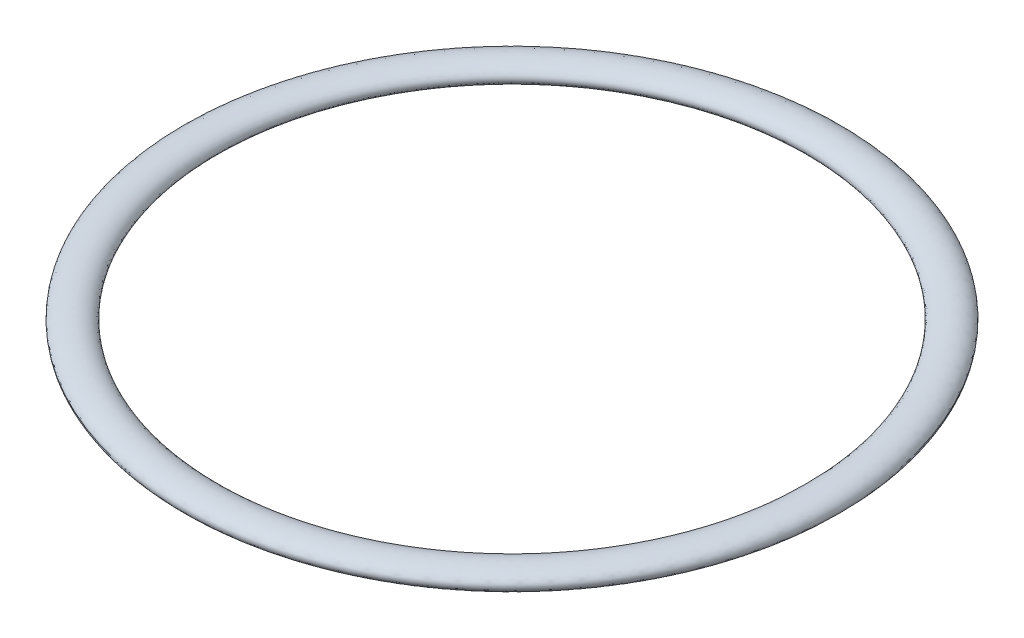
ISO-10303-21;
HEADER;
FILE_DESCRIPTION(('STEP AP214'),'2;1');
FILE_NAME('part.step','',(''),(''),'','','');
FILE_SCHEMA(('AUTOMOTIVE_DESIGN { 1 0 10303 214 1 1 1 1 }'));
ENDSEC;
DATA;
#1=APPLICATION_CONTEXT('core data for automotive mechanical design processes');
#2=APPLICATION_PROTOCOL_DEFINITION('international standard','automotive_design',2000,#1);
#3=PRODUCT_CONTEXT('',#1,'mechanical');
#4=PRODUCT('Part','Part','',(#3));
#5=PRODUCT_RELATED_PRODUCT_CATEGORY('part','',(#4));
#6=PRODUCT_DEFINITION_FORMATION('','',#4);
#7=PRODUCT_DEFINITION_CONTEXT('part definition',#1,'design');
#8=PRODUCT_DEFINITION('design','',#6,#7);
#9=PRODUCT_DEFINITION_SHAPE('','',#8);
#10=(LENGTH_UNIT() NAMED_UNIT(*) SI_UNIT(.MILLI.,.METRE.));
#11=(NAMED_UNIT(*) PLANE_ANGLE_UNIT() SI_UNIT($,.RADIAN.));
#12=(NAMED_UNIT(*) SI_UNIT($,.STERADIAN.) SOLID_ANGLE_UNIT());
#13=UNCERTAINTY_MEASURE_WITH_UNIT(LENGTH_MEASURE(1.E-05),#10,'distance_accuracy_value','');
#14=(GEOMETRIC_REPRESENTATION_CONTEXT(3) GLOBAL_UNCERTAINTY_ASSIGNED_CONTEXT((#13)) GLOBAL_UNIT_ASSIGNED_CONTEXT((#10,
#11,#12)) REPRESENTATION_CONTEXT('',''));
#15=CARTESIAN_POINT('',(0.,0.,0.));
#16=DIRECTION('',(0.,0.,1.));
#17=DIRECTION('',(1.,0.,0.));
#18=AXIS2_PLACEMENT_3D('',#15,#16,#17);
#19=CARTESIAN_POINT('',(22.925,-9.725,0.));
#20=DIRECTION('',(0.,0.,1.));
#21=DIRECTION('',(1.,0.,0.));
#22=AXIS2_PLACEMENT_3D('',#19,#20,#21);
#23=ELLIPSE('',#22,1.379310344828,0.725);
#24=CARTESIAN_POINT('',(0.,0.,0.));
#25=DIRECTION('',(0.,-1.,0.));
#26=AXIS1_PLACEMENT('',#24,#25);
#27=SURFACE_OF_REVOLUTION('',#23,#26);
#28=CARTESIAN_POINT('',(22.925,-9.725,0.));
#29=DIRECTION('',(0.,0.,1.));
#30=DIRECTION('',(1.,0.,0.));
#31=AXIS2_PLACEMENT_3D('',#28,#29,#30);
#32=ELLIPSE('',#31,1.379310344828,0.725);
#33=CARTESIAN_POINT('',(24.304310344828,-9.725,0.));
#34=VERTEX_POINT('',#33);
#35=EDGE_CURVE('E19',#34,#34,#32,.T.);
#36=ORIENTED_EDGE('',*,*,#35,.F.);
#37=CARTESIAN_POINT('',(0.,-9.725,0.));
#38=DIRECTION('',(0.,1.,0.));
#39=DIRECTION('',(1.,0.,0.));
#40=AXIS2_PLACEMENT_3D('',#37,#38,#39);
#41=CIRCLE('',#40,24.304310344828);
#42=EDGE_CURVE('E10',#34,#34,#41,.T.);
#43=ORIENTED_EDGE('',*,*,#42,.T.);
#44=ORIENTED_EDGE('',*,*,#35,.T.);
#45=ORIENTED_EDGE('',*,*,#42,.F.);
#46=EDGE_LOOP('',(#36,#43,#44,#45));
#47=FACE_BOUND('',#46,.T.);
#48=ADVANCED_FACE('F16',(#47),#27,.F.);
#49=CLOSED_SHELL('',(#48));
#50=MANIFOLD_SOLID_BREP('B1',#49);
#51=ADVANCED_BREP_SHAPE_REPRESENTATION('',(#18,#50),#14);
#52=SHAPE_DEFINITION_REPRESENTATION(#9,#51);
ENDSEC;
END-ISO-10303-21;
